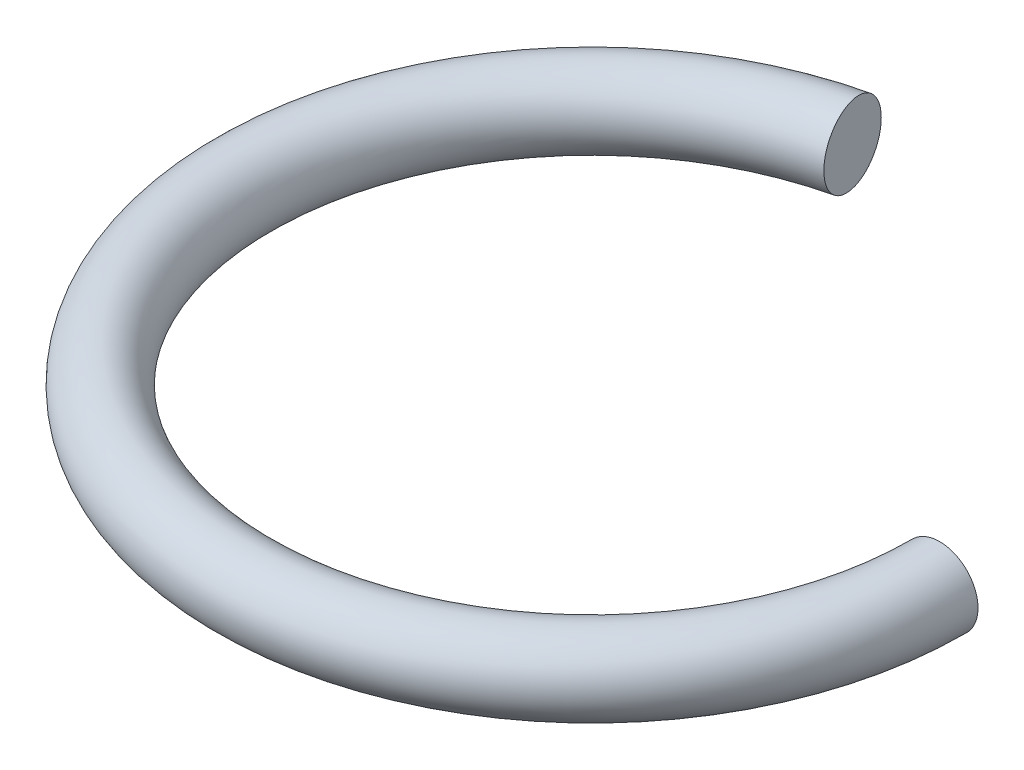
ISO-10303-21;
HEADER;
FILE_DESCRIPTION(('STEP AP214'),'2;1');
FILE_NAME('part.step','',(''),(''),'','','');
FILE_SCHEMA(('AUTOMOTIVE_DESIGN { 1 0 10303 214 1 1 1 1 }'));
ENDSEC;
DATA;
#1=APPLICATION_CONTEXT('core data for automotive mechanical design processes');
#2=APPLICATION_PROTOCOL_DEFINITION('international standard','automotive_design',2000,#1);
#3=PRODUCT_CONTEXT('',#1,'mechanical');
#4=PRODUCT('Part','Part','',(#3));
#5=PRODUCT_RELATED_PRODUCT_CATEGORY('part','',(#4));
#6=PRODUCT_DEFINITION_FORMATION('','',#4);
#7=PRODUCT_DEFINITION_CONTEXT('part definition',#1,'design');
#8=PRODUCT_DEFINITION('design','',#6,#7);
#9=PRODUCT_DEFINITION_SHAPE('','',#8);
#10=(LENGTH_UNIT() NAMED_UNIT(*) SI_UNIT(.MILLI.,.METRE.));
#11=(NAMED_UNIT(*) PLANE_ANGLE_UNIT() SI_UNIT($,.RADIAN.));
#12=(NAMED_UNIT(*) SI_UNIT($,.STERADIAN.) SOLID_ANGLE_UNIT());
#13=UNCERTAINTY_MEASURE_WITH_UNIT(LENGTH_MEASURE(1.E-05),#10,'distance_accuracy_value','');
#14=(GEOMETRIC_REPRESENTATION_CONTEXT(3) GLOBAL_UNCERTAINTY_ASSIGNED_CONTEXT((#13)) GLOBAL_UNIT_ASSIGNED_CONTEXT((#10,
#11,#12)) REPRESENTATION_CONTEXT('',''));
#15=CARTESIAN_POINT('',(0.,0.,0.));
#16=DIRECTION('',(0.,0.,1.));
#17=DIRECTION('',(1.,0.,0.));
#18=AXIS2_PLACEMENT_3D('',#15,#16,#17);
#19=CARTESIAN_POINT('',(0.203748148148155,-13.2172665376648,0.));
#20=DIRECTION('',(0.,1.,0.));
#21=DIRECTION('',(-1.,0.,0.));
#22=AXIS2_PLACEMENT_3D('',#19,#20,#21);
#23=TOROIDAL_SURFACE('',#22,11.2158318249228,1.235);
#24=CARTESIAN_POINT('',(-2.31926504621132,-13.2172665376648,-10.9283707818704));
#25=DIRECTION('',(0.974370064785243,0.,-0.224951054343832));
#26=DIRECTION('',(-0.224951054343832,0.,-0.974370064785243));
#27=AXIS2_PLACEMENT_3D('',#24,#25,#26);
#28=CIRCLE('',#27,1.235);
#29=CARTESIAN_POINT('',(-2.59707959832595,-13.2172665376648,-12.1317178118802));
#30=VERTEX_POINT('',#29);
#31=EDGE_CURVE('E10',#30,#30,#28,.T.);
#32=CARTESIAN_POINT('',(11.4195799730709,-13.2172665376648,0.));
#33=DIRECTION('',(0.,0.,1.));
#34=DIRECTION('',(1.,0.,0.));
#35=AXIS2_PLACEMENT_3D('',#32,#33,#34);
#36=CIRCLE('',#35,1.235);
#37=CARTESIAN_POINT('',(12.6545799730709,-13.2172665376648,0.));
#38=VERTEX_POINT('',#37);
#39=EDGE_CURVE('E35',#38,#38,#36,.T.);
#40=CARTESIAN_POINT('',(0.203748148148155,-13.2172665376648,0.));
#41=DIRECTION('',(0.,1.,0.));
#42=DIRECTION('',(-1.,0.,0.));
#43=AXIS2_PLACEMENT_3D('',#40,#41,#42);
#44=CIRCLE('',#43,12.4508318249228);
#45=EDGE_CURVE('',#30,#38,#44,.T.);
#46=ORIENTED_EDGE('',*,*,#31,.F.);
#47=ORIENTED_EDGE('',*,*,#39,.T.);
#48=ORIENTED_EDGE('',*,*,#45,.T.);
#49=ORIENTED_EDGE('',*,*,#45,.F.);
#50=EDGE_LOOP('',(#46,#48,#47,#49));
#51=FACE_BOUND('',#50,.T.);
#52=ADVANCED_FACE('F29',(#51),#23,.T.);
#53=CARTESIAN_POINT('',(-2.31926504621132,-13.2172665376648,-10.9283707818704));
#54=DIRECTION('',(0.974370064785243,0.,-0.224951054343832));
#55=DIRECTION('',(-0.224951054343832,0.,-0.974370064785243));
#56=AXIS2_PLACEMENT_3D('',#53,#54,#55);
#57=PLANE('',#56);
#58=ORIENTED_EDGE('',*,*,#31,.T.);
#59=EDGE_LOOP('',(#58));
#60=FACE_BOUND('',#59,.T.);
#61=ADVANCED_FACE('F44',(#60),#57,.T.);
#62=CARTESIAN_POINT('',(11.4195799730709,-13.2172665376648,0.));
#63=DIRECTION('',(0.,0.,1.));
#64=DIRECTION('',(1.,0.,0.));
#65=AXIS2_PLACEMENT_3D('',#62,#63,#64);
#66=PLANE('',#65);
#67=ORIENTED_EDGE('',*,*,#39,.F.);
#68=EDGE_LOOP('',(#67));
#69=FACE_BOUND('',#68,.T.);
#70=ADVANCED_FACE('F42',(#69),#66,.F.);
#71=CLOSED_SHELL('',(#52,#61,#70));
#72=MANIFOLD_SOLID_BREP('B2',#71);
#73=ADVANCED_BREP_SHAPE_REPRESENTATION('',(#18,#72),#14);
#74=SHAPE_DEFINITION_REPRESENTATION(#9,#73);
ENDSEC;
END-ISO-10303-21;
